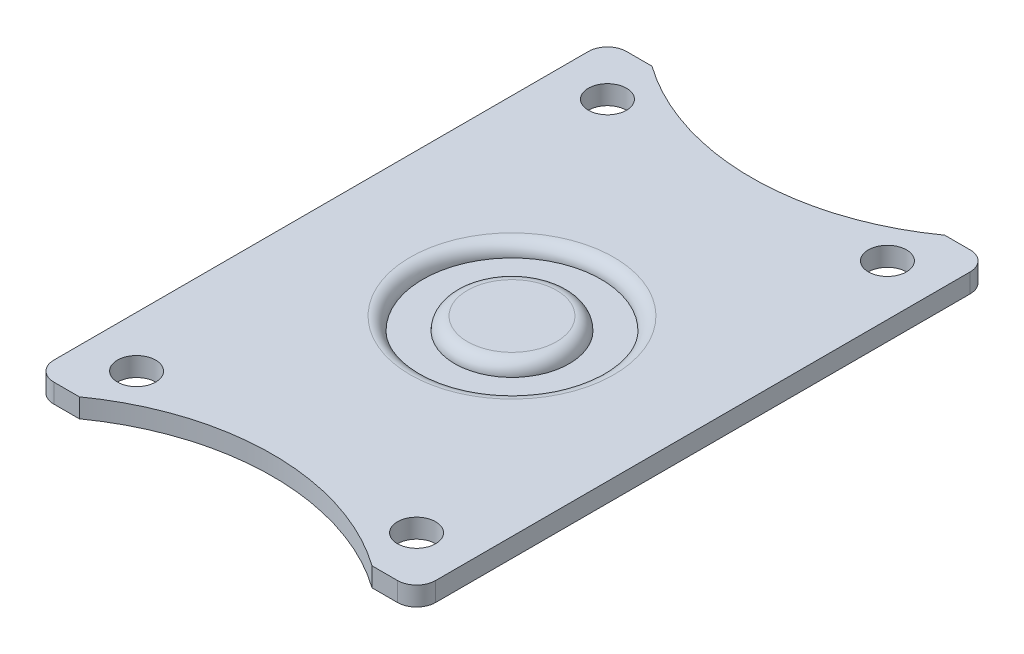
ISO-10303-21;
HEADER;
FILE_DESCRIPTION(('STEP AP214'),'2;1');
FILE_NAME('part.step','',(''),(''),'','','');
FILE_SCHEMA(('AUTOMOTIVE_DESIGN { 1 0 10303 214 1 1 1 1 }'));
ENDSEC;
DATA;
#1=APPLICATION_CONTEXT('core data for automotive mechanical design processes');
#2=APPLICATION_PROTOCOL_DEFINITION('international standard','automotive_design',2000,#1);
#3=PRODUCT_CONTEXT('',#1,'mechanical');
#4=PRODUCT('Part','Part','',(#3));
#5=PRODUCT_RELATED_PRODUCT_CATEGORY('part','',(#4));
#6=PRODUCT_DEFINITION_FORMATION('','',#4);
#7=PRODUCT_DEFINITION_CONTEXT('part definition',#1,'design');
#8=PRODUCT_DEFINITION('design','',#6,#7);
#9=PRODUCT_DEFINITION_SHAPE('','',#8);
#10=(LENGTH_UNIT() NAMED_UNIT(*) SI_UNIT(.MILLI.,.METRE.));
#11=(NAMED_UNIT(*) PLANE_ANGLE_UNIT() SI_UNIT($,.RADIAN.));
#12=(NAMED_UNIT(*) SI_UNIT($,.STERADIAN.) SOLID_ANGLE_UNIT());
#13=UNCERTAINTY_MEASURE_WITH_UNIT(LENGTH_MEASURE(1.E-05),#10,'distance_accuracy_value','');
#14=(GEOMETRIC_REPRESENTATION_CONTEXT(3) GLOBAL_UNCERTAINTY_ASSIGNED_CONTEXT((#13)) GLOBAL_UNIT_ASSIGNED_CONTEXT((#10,
#11,#12)) REPRESENTATION_CONTEXT('',''));
#15=CARTESIAN_POINT('',(0.,0.,0.));
#16=DIRECTION('',(0.,0.,1.));
#17=DIRECTION('',(1.,0.,0.));
#18=AXIS2_PLACEMENT_3D('',#15,#16,#17);
#19=CARTESIAN_POINT('',(-30.,3.,-45.));
#20=DIRECTION('',(0.,0.,1.));
#21=DIRECTION('',(1.,0.,0.));
#22=AXIS2_PLACEMENT_3D('',#19,#20,#21);
#23=PLANE('',#22);
#24=DIRECTION('',(-1.,0.,0.));
#25=VECTOR('',#24,1.);
#26=CARTESIAN_POINT('',(-30.,0.,-45.));
#27=LINE('',#26,#25);
#28=CARTESIAN_POINT('',(27.,0.,-45.));
#29=VERTEX_POINT('',#28);
#30=CARTESIAN_POINT('',(23.,0.,-45.));
#31=VERTEX_POINT('',#30);
#32=EDGE_CURVE('E161',#29,#31,#27,.T.);
#33=ORIENTED_EDGE('',*,*,#32,.T.);
#34=DIRECTION('',(0.,1.,0.));
#35=VECTOR('',#34,1.);
#36=CARTESIAN_POINT('',(23.,-7.,-45.));
#37=LINE('',#36,#35);
#38=CARTESIAN_POINT('',(23.,3.,-45.));
#39=VERTEX_POINT('',#38);
#40=EDGE_CURVE('E58',#31,#39,#37,.T.);
#41=ORIENTED_EDGE('',*,*,#40,.T.);
#42=DIRECTION('',(-1.,0.,0.));
#43=VECTOR('',#42,1.);
#44=CARTESIAN_POINT('',(-30.,3.,-45.));
#45=LINE('',#44,#43);
#46=CARTESIAN_POINT('',(27.,3.,-45.));
#47=VERTEX_POINT('',#46);
#48=EDGE_CURVE('E276',#47,#39,#45,.T.);
#49=ORIENTED_EDGE('',*,*,#48,.F.);
#50=DIRECTION('',(0.,-1.,0.));
#51=VECTOR('',#50,1.);
#52=CARTESIAN_POINT('',(27.,3.,-45.));
#53=LINE('',#52,#51);
#54=EDGE_CURVE('E201',#47,#29,#53,.T.);
#55=ORIENTED_EDGE('',*,*,#54,.T.);
#56=EDGE_LOOP('',(#33,#41,#49,#55));
#57=FACE_BOUND('',#56,.T.);
#58=ADVANCED_FACE('F35',(#57),#23,.F.);
#59=CARTESIAN_POINT('',(-30.,3.,45.));
#60=DIRECTION('',(0.,0.,-1.));
#61=DIRECTION('',(-1.,0.,0.));
#62=AXIS2_PLACEMENT_3D('',#59,#60,#61);
#63=PLANE('',#62);
#64=DIRECTION('',(1.,0.,0.));
#65=VECTOR('',#64,1.);
#66=CARTESIAN_POINT('',(-30.,0.,45.));
#67=LINE('',#66,#65);
#68=CARTESIAN_POINT('',(-27.,0.,45.));
#69=VERTEX_POINT('',#68);
#70=CARTESIAN_POINT('',(-23.,0.,45.));
#71=VERTEX_POINT('',#70);
#72=EDGE_CURVE('E139',#69,#71,#67,.T.);
#73=ORIENTED_EDGE('',*,*,#72,.T.);
#74=DIRECTION('',(0.,1.,0.));
#75=VECTOR('',#74,1.);
#76=CARTESIAN_POINT('',(-23.,-7.,45.));
#77=LINE('',#76,#75);
#78=CARTESIAN_POINT('',(-23.,3.,45.));
#79=VERTEX_POINT('',#78);
#80=EDGE_CURVE('E50',#71,#79,#77,.T.);
#81=ORIENTED_EDGE('',*,*,#80,.T.);
#82=DIRECTION('',(1.,0.,0.));
#83=VECTOR('',#82,1.);
#84=CARTESIAN_POINT('',(-30.,3.,45.));
#85=LINE('',#84,#83);
#86=CARTESIAN_POINT('',(-27.,3.,45.));
#87=VERTEX_POINT('',#86);
#88=EDGE_CURVE('E136',#87,#79,#85,.T.);
#89=ORIENTED_EDGE('',*,*,#88,.F.);
#90=DIRECTION('',(0.,-1.,0.));
#91=VECTOR('',#90,1.);
#92=CARTESIAN_POINT('',(-27.,3.,45.));
#93=LINE('',#92,#91);
#94=EDGE_CURVE('E219',#87,#69,#93,.T.);
#95=ORIENTED_EDGE('',*,*,#94,.T.);
#96=EDGE_LOOP('',(#73,#81,#89,#95));
#97=FACE_BOUND('',#96,.T.);
#98=ADVANCED_FACE('F134',(#97),#63,.F.);
#99=CARTESIAN_POINT('',(30.,3.,-45.));
#100=DIRECTION('',(-1.,0.,0.));
#101=DIRECTION('',(0.,0.,1.));
#102=AXIS2_PLACEMENT_3D('',#99,#100,#101);
#103=PLANE('',#102);
#104=DIRECTION('',(0.,0.,-1.));
#105=VECTOR('',#104,1.);
#106=CARTESIAN_POINT('',(30.,0.,-45.));
#107=LINE('',#106,#105);
#108=CARTESIAN_POINT('',(30.,0.,42.));
#109=VERTEX_POINT('',#108);
#110=CARTESIAN_POINT('',(30.,0.,-42.));
#111=VERTEX_POINT('',#110);
#112=EDGE_CURVE('E156',#109,#111,#107,.T.);
#113=ORIENTED_EDGE('',*,*,#112,.T.);
#114=DIRECTION('',(0.,-1.,0.));
#115=VECTOR('',#114,1.);
#116=CARTESIAN_POINT('',(30.,3.,-42.));
#117=LINE('',#116,#115);
#118=CARTESIAN_POINT('',(30.,3.,-42.));
#119=VERTEX_POINT('',#118);
#120=EDGE_CURVE('E217',#111,#119,#117,.F.);
#121=ORIENTED_EDGE('',*,*,#120,.T.);
#122=DIRECTION('',(0.,0.,-1.));
#123=VECTOR('',#122,1.);
#124=CARTESIAN_POINT('',(30.,3.,-45.));
#125=LINE('',#124,#123);
#126=CARTESIAN_POINT('',(30.,3.,42.));
#127=VERTEX_POINT('',#126);
#128=EDGE_CURVE('E169',#127,#119,#125,.T.);
#129=ORIENTED_EDGE('',*,*,#128,.F.);
#130=DIRECTION('',(0.,-1.,0.));
#131=VECTOR('',#130,1.);
#132=CARTESIAN_POINT('',(30.,3.,42.));
#133=LINE('',#132,#131);
#134=EDGE_CURVE('E214',#127,#109,#133,.T.);
#135=ORIENTED_EDGE('',*,*,#134,.T.);
#136=EDGE_LOOP('',(#113,#121,#129,#135));
#137=FACE_BOUND('',#136,.T.);
#138=ADVANCED_FACE('F318',(#137),#103,.F.);
#139=CARTESIAN_POINT('',(-23.,3.,-45.));
#140=VERTEX_POINT('',#139);
#141=CARTESIAN_POINT('',(-27.,3.,-45.));
#142=VERTEX_POINT('',#141);
#143=EDGE_CURVE('E275',#140,#142,#45,.T.);
#144=ORIENTED_EDGE('',*,*,#143,.F.);
#145=DIRECTION('',(0.,1.,0.));
#146=VECTOR('',#145,1.);
#147=CARTESIAN_POINT('',(-23.,-7.,-45.));
#148=LINE('',#147,#146);
#149=CARTESIAN_POINT('',(-23.,0.,-45.));
#150=VERTEX_POINT('',#149);
#151=EDGE_CURVE('E129',#150,#140,#148,.T.);
#152=ORIENTED_EDGE('',*,*,#151,.F.);
#153=CARTESIAN_POINT('',(-27.,0.,-45.));
#154=VERTEX_POINT('',#153);
#155=EDGE_CURVE('E159',#150,#154,#27,.T.);
#156=ORIENTED_EDGE('',*,*,#155,.T.);
#157=DIRECTION('',(0.,-1.,0.));
#158=VECTOR('',#157,1.);
#159=CARTESIAN_POINT('',(-27.,3.,-45.));
#160=LINE('',#159,#158);
#161=EDGE_CURVE('E204',#154,#142,#160,.F.);
#162=ORIENTED_EDGE('',*,*,#161,.T.);
#163=EDGE_LOOP('',(#144,#152,#156,#162));
#164=FACE_BOUND('',#163,.T.);
#165=ADVANCED_FACE('F286',(#164),#23,.F.);
#166=CARTESIAN_POINT('',(-30.,3.,-45.));
#167=DIRECTION('',(1.,0.,0.));
#168=DIRECTION('',(0.,0.,-1.));
#169=AXIS2_PLACEMENT_3D('',#166,#167,#168);
#170=PLANE('',#169);
#171=DIRECTION('',(0.,0.,1.));
#172=VECTOR('',#171,1.);
#173=CARTESIAN_POINT('',(-30.,3.,-45.));
#174=LINE('',#173,#172);
#175=CARTESIAN_POINT('',(-30.,3.,-42.));
#176=VERTEX_POINT('',#175);
#177=CARTESIAN_POINT('',(-30.,3.,42.));
#178=VERTEX_POINT('',#177);
#179=EDGE_CURVE('E152',#176,#178,#174,.T.);
#180=ORIENTED_EDGE('',*,*,#179,.F.);
#181=DIRECTION('',(0.,-1.,0.));
#182=VECTOR('',#181,1.);
#183=CARTESIAN_POINT('',(-30.,3.,-42.));
#184=LINE('',#183,#182);
#185=CARTESIAN_POINT('',(-30.,0.,-42.));
#186=VERTEX_POINT('',#185);
#187=EDGE_CURVE('E188',#176,#186,#184,.T.);
#188=ORIENTED_EDGE('',*,*,#187,.T.);
#189=DIRECTION('',(0.,0.,1.));
#190=VECTOR('',#189,1.);
#191=CARTESIAN_POINT('',(-30.,0.,-45.));
#192=LINE('',#191,#190);
#193=CARTESIAN_POINT('',(-30.,0.,42.));
#194=VERTEX_POINT('',#193);
#195=EDGE_CURVE('E164',#186,#194,#192,.T.);
#196=ORIENTED_EDGE('',*,*,#195,.T.);
#197=DIRECTION('',(0.,-1.,0.));
#198=VECTOR('',#197,1.);
#199=CARTESIAN_POINT('',(-30.,3.,42.));
#200=LINE('',#199,#198);
#201=EDGE_CURVE('E177',#194,#178,#200,.F.);
#202=ORIENTED_EDGE('',*,*,#201,.T.);
#203=EDGE_LOOP('',(#180,#188,#196,#202));
#204=FACE_BOUND('',#203,.T.);
#205=ADVANCED_FACE('F293',(#204),#170,.F.);
#206=CARTESIAN_POINT('',(23.,3.,45.));
#207=VERTEX_POINT('',#206);
#208=CARTESIAN_POINT('',(27.,3.,45.));
#209=VERTEX_POINT('',#208);
#210=EDGE_CURVE('E147',#207,#209,#85,.T.);
#211=ORIENTED_EDGE('',*,*,#210,.F.);
#212=DIRECTION('',(0.,1.,0.));
#213=VECTOR('',#212,1.);
#214=CARTESIAN_POINT('',(23.,-7.,45.));
#215=LINE('',#214,#213);
#216=CARTESIAN_POINT('',(23.,0.,45.));
#217=VERTEX_POINT('',#216);
#218=EDGE_CURVE('E125',#217,#207,#215,.T.);
#219=ORIENTED_EDGE('',*,*,#218,.F.);
#220=CARTESIAN_POINT('',(27.,0.,45.));
#221=VERTEX_POINT('',#220);
#222=EDGE_CURVE('E167',#217,#221,#67,.T.);
#223=ORIENTED_EDGE('',*,*,#222,.T.);
#224=DIRECTION('',(0.,-1.,0.));
#225=VECTOR('',#224,1.);
#226=CARTESIAN_POINT('',(27.,3.,45.));
#227=LINE('',#226,#225);
#228=EDGE_CURVE('E221',#221,#209,#227,.F.);
#229=ORIENTED_EDGE('',*,*,#228,.T.);
#230=EDGE_LOOP('',(#211,#219,#223,#229));
#231=FACE_BOUND('',#230,.T.);
#232=ADVANCED_FACE('F320',(#231),#63,.F.);
#233=CARTESIAN_POINT('',(0.,3.,0.));
#234=DIRECTION('',(0.,1.,0.));
#235=DIRECTION('',(0.,0.,1.));
#236=AXIS2_PLACEMENT_3D('',#233,#234,#235);
#237=PLANE('',#236);
#238=CARTESIAN_POINT('',(0.,3.,0.));
#239=DIRECTION('',(0.,1.,0.));
#240=DIRECTION('',(0.,0.,1.));
#241=AXIS2_PLACEMENT_3D('',#238,#239,#240);
#242=CIRCLE('',#241,16.);
#243=CARTESIAN_POINT('',(0.,3.,16.));
#244=VERTEX_POINT('',#243);
#245=EDGE_CURVE('E43',#244,#244,#242,.F.);
#246=ORIENTED_EDGE('',*,*,#245,.T.);
#247=EDGE_LOOP('',(#246));
#248=FACE_BOUND('',#247,.T.);
#249=CARTESIAN_POINT('',(0.,3.,77.2554782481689));
#250=DIRECTION('',(0.,1.,0.));
#251=DIRECTION('',(0.,0.,-1.));
#252=AXIS2_PLACEMENT_3D('',#249,#250,#251);
#253=CIRCLE('',#252,39.6158538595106);
#254=EDGE_CURVE('E122',#207,#79,#253,.T.);
#255=ORIENTED_EDGE('',*,*,#254,.F.);
#256=ORIENTED_EDGE('',*,*,#210,.T.);
#257=CARTESIAN_POINT('',(27.,3.,42.));
#258=DIRECTION('',(0.,1.,0.));
#259=DIRECTION('',(0.,0.,1.));
#260=AXIS2_PLACEMENT_3D('',#257,#258,#259);
#261=CIRCLE('',#260,3.);
#262=EDGE_CURVE('E208',#209,#127,#261,.T.);
#263=ORIENTED_EDGE('',*,*,#262,.T.);
#264=ORIENTED_EDGE('',*,*,#128,.T.);
#265=CARTESIAN_POINT('',(27.,3.,-42.));
#266=DIRECTION('',(0.,1.,0.));
#267=DIRECTION('',(0.,0.,1.));
#268=AXIS2_PLACEMENT_3D('',#265,#266,#267);
#269=CIRCLE('',#268,3.);
#270=EDGE_CURVE('E210',#119,#47,#269,.T.);
#271=ORIENTED_EDGE('',*,*,#270,.T.);
#272=ORIENTED_EDGE('',*,*,#48,.T.);
#273=CARTESIAN_POINT('',(0.,3.,-77.2554782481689));
#274=DIRECTION('',(0.,1.,0.));
#275=DIRECTION('',(0.,0.,1.));
#276=AXIS2_PLACEMENT_3D('',#273,#274,#275);
#277=CIRCLE('',#276,39.6158538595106);
#278=EDGE_CURVE('E240',#140,#39,#277,.T.);
#279=ORIENTED_EDGE('',*,*,#278,.F.);
#280=ORIENTED_EDGE('',*,*,#143,.T.);
#281=CARTESIAN_POINT('',(-27.,3.,-42.));
#282=DIRECTION('',(0.,1.,0.));
#283=DIRECTION('',(0.,0.,1.));
#284=AXIS2_PLACEMENT_3D('',#281,#282,#283);
#285=CIRCLE('',#284,3.);
#286=EDGE_CURVE('E212',#142,#176,#285,.T.);
#287=ORIENTED_EDGE('',*,*,#286,.T.);
#288=ORIENTED_EDGE('',*,*,#179,.T.);
#289=CARTESIAN_POINT('',(-27.,3.,42.));
#290=DIRECTION('',(0.,1.,0.));
#291=DIRECTION('',(0.,0.,1.));
#292=AXIS2_PLACEMENT_3D('',#289,#290,#291);
#293=CIRCLE('',#292,3.);
#294=EDGE_CURVE('E145',#178,#87,#293,.T.);
#295=ORIENTED_EDGE('',*,*,#294,.T.);
#296=ORIENTED_EDGE('',*,*,#88,.T.);
#297=EDGE_LOOP('',(#255,#256,#263,#264,#271,#272,#279,#280,#287,#288,#295,#296));
#298=FACE_BOUND('',#297,.T.);
#299=CARTESIAN_POINT('',(-22.,3.,-37.));
#300=DIRECTION('',(0.,1.,0.));
#301=DIRECTION('',(0.,0.,1.));
#302=AXIS2_PLACEMENT_3D('',#299,#300,#301);
#303=CIRCLE('',#302,3.);
#304=CARTESIAN_POINT('',(-22.,3.,-34.));
#305=VERTEX_POINT('',#304);
#306=EDGE_CURVE('E247',#305,#305,#303,.T.);
#307=ORIENTED_EDGE('',*,*,#306,.F.);
#308=EDGE_LOOP('',(#307));
#309=FACE_BOUND('',#308,.T.);
#310=CARTESIAN_POINT('',(22.,3.,-37.));
#311=DIRECTION('',(0.,1.,0.));
#312=DIRECTION('',(0.,0.,1.));
#313=AXIS2_PLACEMENT_3D('',#310,#311,#312);
#314=CIRCLE('',#313,3.);
#315=CARTESIAN_POINT('',(22.,3.,-34.));
#316=VERTEX_POINT('',#315);
#317=EDGE_CURVE('E256',#316,#316,#314,.T.);
#318=ORIENTED_EDGE('',*,*,#317,.F.);
#319=EDGE_LOOP('',(#318));
#320=FACE_BOUND('',#319,.T.);
#321=CARTESIAN_POINT('',(-22.,3.,37.));
#322=DIRECTION('',(0.,1.,0.));
#323=DIRECTION('',(0.,0.,1.));
#324=AXIS2_PLACEMENT_3D('',#321,#322,#323);
#325=CIRCLE('',#324,3.);
#326=CARTESIAN_POINT('',(-22.,3.,40.));
#327=VERTEX_POINT('',#326);
#328=EDGE_CURVE('E186',#327,#327,#325,.T.);
#329=ORIENTED_EDGE('',*,*,#328,.F.);
#330=EDGE_LOOP('',(#329));
#331=FACE_BOUND('',#330,.T.);
#332=CARTESIAN_POINT('',(22.,3.,37.));
#333=DIRECTION('',(0.,1.,0.));
#334=DIRECTION('',(0.,0.,1.));
#335=AXIS2_PLACEMENT_3D('',#332,#333,#334);
#336=CIRCLE('',#335,3.);
#337=CARTESIAN_POINT('',(22.,3.,40.));
#338=VERTEX_POINT('',#337);
#339=EDGE_CURVE('E182',#338,#338,#336,.T.);
#340=ORIENTED_EDGE('',*,*,#339,.F.);
#341=EDGE_LOOP('',(#340));
#342=FACE_BOUND('',#341,.T.);
#343=ADVANCED_FACE('F141',(#248,#298,#309,#320,#331,#342),#237,.T.);
#344=CARTESIAN_POINT('',(0.,0.,0.));
#345=DIRECTION('',(0.,1.,0.));
#346=DIRECTION('',(0.,0.,1.));
#347=AXIS2_PLACEMENT_3D('',#344,#345,#346);
#348=PLANE('',#347);
#349=CARTESIAN_POINT('',(-22.,0.,-37.));
#350=DIRECTION('',(0.,1.,0.));
#351=DIRECTION('',(0.,0.,1.));
#352=AXIS2_PLACEMENT_3D('',#349,#350,#351);
#353=CIRCLE('',#352,3.);
#354=CARTESIAN_POINT('',(-22.,0.,-34.));
#355=VERTEX_POINT('',#354);
#356=EDGE_CURVE('E253',#355,#355,#353,.T.);
#357=ORIENTED_EDGE('',*,*,#356,.T.);
#358=EDGE_LOOP('',(#357));
#359=FACE_BOUND('',#358,.T.);
#360=CARTESIAN_POINT('',(22.,0.,-37.));
#361=DIRECTION('',(0.,1.,0.));
#362=DIRECTION('',(0.,0.,1.));
#363=AXIS2_PLACEMENT_3D('',#360,#361,#362);
#364=CIRCLE('',#363,3.);
#365=CARTESIAN_POINT('',(22.,0.,-34.));
#366=VERTEX_POINT('',#365);
#367=EDGE_CURVE('E259',#366,#366,#364,.T.);
#368=ORIENTED_EDGE('',*,*,#367,.T.);
#369=EDGE_LOOP('',(#368));
#370=FACE_BOUND('',#369,.T.);
#371=CARTESIAN_POINT('',(-22.,0.,37.));
#372=DIRECTION('',(0.,1.,0.));
#373=DIRECTION('',(0.,0.,1.));
#374=AXIS2_PLACEMENT_3D('',#371,#372,#373);
#375=CIRCLE('',#374,3.);
#376=CARTESIAN_POINT('',(-22.,0.,40.));
#377=VERTEX_POINT('',#376);
#378=EDGE_CURVE('E183',#377,#377,#375,.T.);
#379=ORIENTED_EDGE('',*,*,#378,.T.);
#380=EDGE_LOOP('',(#379));
#381=FACE_BOUND('',#380,.T.);
#382=CARTESIAN_POINT('',(22.,0.,37.));
#383=DIRECTION('',(0.,1.,0.));
#384=DIRECTION('',(0.,0.,1.));
#385=AXIS2_PLACEMENT_3D('',#382,#383,#384);
#386=CIRCLE('',#385,3.);
#387=CARTESIAN_POINT('',(22.,0.,40.));
#388=VERTEX_POINT('',#387);
#389=EDGE_CURVE('E178',#388,#388,#386,.T.);
#390=ORIENTED_EDGE('',*,*,#389,.T.);
#391=EDGE_LOOP('',(#390));
#392=FACE_BOUND('',#391,.T.);
#393=CARTESIAN_POINT('',(0.,0.,0.));
#394=DIRECTION('',(0.,-1.,0.));
#395=DIRECTION('',(0.,0.,-1.));
#396=AXIS2_PLACEMENT_3D('',#393,#394,#395);
#397=CIRCLE('',#396,11.);
#398=CARTESIAN_POINT('',(0.,0.,-11.));
#399=VERTEX_POINT('',#398);
#400=EDGE_CURVE('E146',#399,#399,#397,.T.);
#401=ORIENTED_EDGE('',*,*,#400,.F.);
#402=EDGE_LOOP('',(#401));
#403=FACE_BOUND('',#402,.T.);
#404=ORIENTED_EDGE('',*,*,#222,.F.);
#405=CARTESIAN_POINT('',(0.,0.,77.2554782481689));
#406=DIRECTION('',(0.,1.,0.));
#407=DIRECTION('',(0.,0.,1.));
#408=AXIS2_PLACEMENT_3D('',#405,#406,#407);
#409=CIRCLE('',#408,39.6158538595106);
#410=EDGE_CURVE('E226',#217,#71,#409,.T.);
#411=ORIENTED_EDGE('',*,*,#410,.T.);
#412=ORIENTED_EDGE('',*,*,#72,.F.);
#413=CARTESIAN_POINT('',(-27.,0.,42.));
#414=DIRECTION('',(0.,1.,0.));
#415=DIRECTION('',(0.,0.,1.));
#416=AXIS2_PLACEMENT_3D('',#413,#414,#415);
#417=CIRCLE('',#416,3.);
#418=EDGE_CURVE('E191',#69,#194,#417,.F.);
#419=ORIENTED_EDGE('',*,*,#418,.T.);
#420=ORIENTED_EDGE('',*,*,#195,.F.);
#421=CARTESIAN_POINT('',(-27.,0.,-42.));
#422=DIRECTION('',(0.,1.,0.));
#423=DIRECTION('',(0.,0.,1.));
#424=AXIS2_PLACEMENT_3D('',#421,#422,#423);
#425=CIRCLE('',#424,3.);
#426=EDGE_CURVE('E198',#186,#154,#425,.F.);
#427=ORIENTED_EDGE('',*,*,#426,.T.);
#428=ORIENTED_EDGE('',*,*,#155,.F.);
#429=CARTESIAN_POINT('',(0.,0.,-77.2554782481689));
#430=DIRECTION('',(0.,1.,0.));
#431=DIRECTION('',(0.,0.,1.));
#432=AXIS2_PLACEMENT_3D('',#429,#430,#431);
#433=CIRCLE('',#432,39.6158538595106);
#434=EDGE_CURVE('E224',#150,#31,#433,.T.);
#435=ORIENTED_EDGE('',*,*,#434,.T.);
#436=ORIENTED_EDGE('',*,*,#32,.F.);
#437=CARTESIAN_POINT('',(27.,0.,-42.));
#438=DIRECTION('',(0.,1.,0.));
#439=DIRECTION('',(0.,0.,1.));
#440=AXIS2_PLACEMENT_3D('',#437,#438,#439);
#441=CIRCLE('',#440,3.);
#442=EDGE_CURVE('E196',#29,#111,#441,.F.);
#443=ORIENTED_EDGE('',*,*,#442,.T.);
#444=ORIENTED_EDGE('',*,*,#112,.F.);
#445=CARTESIAN_POINT('',(27.,0.,42.));
#446=DIRECTION('',(0.,1.,0.));
#447=DIRECTION('',(0.,0.,1.));
#448=AXIS2_PLACEMENT_3D('',#445,#446,#447);
#449=CIRCLE('',#448,3.);
#450=EDGE_CURVE('E193',#109,#221,#449,.F.);
#451=ORIENTED_EDGE('',*,*,#450,.T.);
#452=EDGE_LOOP('',(#404,#411,#412,#419,#420,#427,#428,#435,#436,#443,#444,#451));
#453=FACE_BOUND('',#452,.T.);
#454=ADVANCED_FACE('F297',(#359,#370,#381,#392,#403,#453),#348,.F.);
#455=CARTESIAN_POINT('',(0.,-2.,0.));
#456=DIRECTION('',(0.,1.,0.));
#457=DIRECTION('',(0.,0.,1.));
#458=AXIS2_PLACEMENT_3D('',#455,#456,#457);
#459=CYLINDRICAL_SURFACE('',#458,11.);
#460=CARTESIAN_POINT('',(0.,-2.,0.));
#461=DIRECTION('',(0.,-1.,0.));
#462=DIRECTION('',(0.,0.,-1.));
#463=AXIS2_PLACEMENT_3D('',#460,#461,#462);
#464=CIRCLE('',#463,11.);
#465=CARTESIAN_POINT('',(0.,-2.,-11.));
#466=VERTEX_POINT('',#465);
#467=EDGE_CURVE('E160',#466,#466,#464,.T.);
#468=ORIENTED_EDGE('',*,*,#467,.F.);
#469=EDGE_LOOP('',(#468));
#470=FACE_BOUND('',#469,.T.);
#471=ORIENTED_EDGE('',*,*,#400,.T.);
#472=EDGE_LOOP('',(#471));
#473=FACE_BOUND('',#472,.T.);
#474=ADVANCED_FACE('F362',(#470,#473),#459,.T.);
#475=CARTESIAN_POINT('',(0.,-2.,0.));
#476=DIRECTION('',(0.,-1.,0.));
#477=DIRECTION('',(0.,0.,-1.));
#478=AXIS2_PLACEMENT_3D('',#475,#476,#477);
#479=PLANE('',#478);
#480=CARTESIAN_POINT('',(0.,-2.,0.));
#481=DIRECTION('',(0.,-1.,0.));
#482=DIRECTION('',(0.,0.,-1.));
#483=AXIS2_PLACEMENT_3D('',#480,#481,#482);
#484=CIRCLE('',#483,7.5);
#485=CARTESIAN_POINT('',(0.,-2.,-7.5));
#486=VERTEX_POINT('',#485);
#487=EDGE_CURVE('E150',#486,#486,#484,.T.);
#488=ORIENTED_EDGE('',*,*,#487,.F.);
#489=EDGE_LOOP('',(#488));
#490=FACE_BOUND('',#489,.T.);
#491=ORIENTED_EDGE('',*,*,#467,.T.);
#492=EDGE_LOOP('',(#491));
#493=FACE_BOUND('',#492,.T.);
#494=ADVANCED_FACE('F367',(#490,#493),#479,.T.);
#495=CARTESIAN_POINT('',(0.,-10.,0.));
#496=DIRECTION('',(0.,1.,0.));
#497=DIRECTION('',(0.,0.,1.));
#498=AXIS2_PLACEMENT_3D('',#495,#496,#497);
#499=CYLINDRICAL_SURFACE('',#498,7.5);
#500=CARTESIAN_POINT('',(0.,-10.,0.));
#501=DIRECTION('',(0.,-1.,0.));
#502=DIRECTION('',(0.,0.,-1.));
#503=AXIS2_PLACEMENT_3D('',#500,#501,#502);
#504=CIRCLE('',#503,7.5);
#505=CARTESIAN_POINT('',(0.,-10.,-7.5));
#506=VERTEX_POINT('',#505);
#507=EDGE_CURVE('E181',#506,#506,#504,.T.);
#508=ORIENTED_EDGE('',*,*,#507,.F.);
#509=EDGE_LOOP('',(#508));
#510=FACE_BOUND('',#509,.T.);
#511=ORIENTED_EDGE('',*,*,#487,.T.);
#512=EDGE_LOOP('',(#511));
#513=FACE_BOUND('',#512,.T.);
#514=ADVANCED_FACE('F371',(#510,#513),#499,.T.);
#515=CARTESIAN_POINT('',(0.,-10.,0.));
#516=DIRECTION('',(0.,-1.,0.));
#517=DIRECTION('',(0.,0.,-1.));
#518=AXIS2_PLACEMENT_3D('',#515,#516,#517);
#519=PLANE('',#518);
#520=CARTESIAN_POINT('',(0.,-10.,0.));
#521=DIRECTION('',(0.,-1.,0.));
#522=DIRECTION('',(0.,0.,-1.));
#523=AXIS2_PLACEMENT_3D('',#520,#521,#522);
#524=CIRCLE('',#523,7.15);
#525=CARTESIAN_POINT('',(0.,-10.,-7.15));
#526=VERTEX_POINT('',#525);
#527=EDGE_CURVE('E174',#526,#526,#524,.T.);
#528=ORIENTED_EDGE('',*,*,#527,.F.);
#529=EDGE_LOOP('',(#528));
#530=FACE_BOUND('',#529,.T.);
#531=ORIENTED_EDGE('',*,*,#507,.T.);
#532=EDGE_LOOP('',(#531));
#533=FACE_BOUND('',#532,.T.);
#534=ADVANCED_FACE('F375',(#530,#533),#519,.T.);
#535=CARTESIAN_POINT('',(0.,-12.5,0.));
#536=DIRECTION('',(0.,1.,0.));
#537=DIRECTION('',(0.,0.,1.));
#538=AXIS2_PLACEMENT_3D('',#535,#536,#537);
#539=CYLINDRICAL_SURFACE('',#538,7.15);
#540=CARTESIAN_POINT('',(0.,-12.,0.));
#541=DIRECTION('',(0.,-1.,0.));
#542=DIRECTION('',(0.,0.,-1.));
#543=AXIS2_PLACEMENT_3D('',#540,#541,#542);
#544=CIRCLE('',#543,7.15);
#545=CARTESIAN_POINT('',(0.,-12.,-7.15));
#546=VERTEX_POINT('',#545);
#547=EDGE_CURVE('E173',#546,#546,#544,.F.);
#548=ORIENTED_EDGE('',*,*,#547,.T.);
#549=EDGE_LOOP('',(#548));
#550=FACE_BOUND('',#549,.T.);
#551=ORIENTED_EDGE('',*,*,#527,.T.);
#552=EDGE_LOOP('',(#551));
#553=FACE_BOUND('',#552,.T.);
#554=ADVANCED_FACE('F379',(#550,#553),#539,.T.);
#555=CARTESIAN_POINT('',(0.,-12.5,0.));
#556=DIRECTION('',(0.,-1.,0.));
#557=DIRECTION('',(0.,0.,-1.));
#558=AXIS2_PLACEMENT_3D('',#555,#556,#557);
#559=PLANE('',#558);
#560=CARTESIAN_POINT('',(0.,-12.5,0.));
#561=DIRECTION('',(0.,-1.,0.));
#562=DIRECTION('',(0.,0.,-1.));
#563=AXIS2_PLACEMENT_3D('',#560,#561,#562);
#564=CIRCLE('',#563,6.65000000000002);
#565=CARTESIAN_POINT('',(0.,-12.5,-6.65000000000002));
#566=VERTEX_POINT('',#565);
#567=EDGE_CURVE('E170',#566,#566,#564,.T.);
#568=ORIENTED_EDGE('',*,*,#567,.T.);
#569=EDGE_LOOP('',(#568));
#570=FACE_BOUND('',#569,.T.);
#571=ADVANCED_FACE('F336',(#570),#559,.T.);
#572=CARTESIAN_POINT('',(0.,-12.5,0.));
#573=DIRECTION('',(0.,1.,0.));
#574=DIRECTION('',(0.,0.,1.));
#575=AXIS2_PLACEMENT_3D('',#572,#573,#574);
#576=CONICAL_SURFACE('',#575,6.65000000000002,0.785398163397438);
#577=ORIENTED_EDGE('',*,*,#547,.F.);
#578=EDGE_LOOP('',(#577));
#579=FACE_BOUND('',#578,.T.);
#580=ORIENTED_EDGE('',*,*,#567,.F.);
#581=EDGE_LOOP('',(#580));
#582=FACE_BOUND('',#581,.T.);
#583=ADVANCED_FACE('F332',(#579,#582),#576,.T.);
#584=CARTESIAN_POINT('',(22.,3.,37.));
#585=DIRECTION('',(0.,1.,0.));
#586=DIRECTION('',(0.,0.,1.));
#587=AXIS2_PLACEMENT_3D('',#584,#585,#586);
#588=CYLINDRICAL_SURFACE('',#587,3.);
#589=ORIENTED_EDGE('',*,*,#339,.T.);
#590=EDGE_LOOP('',(#589));
#591=FACE_BOUND('',#590,.T.);
#592=ORIENTED_EDGE('',*,*,#389,.F.);
#593=EDGE_LOOP('',(#592));
#594=FACE_BOUND('',#593,.T.);
#595=ADVANCED_FACE('F335',(#591,#594),#588,.F.);
#596=CARTESIAN_POINT('',(-22.,3.,37.));
#597=DIRECTION('',(0.,1.,0.));
#598=DIRECTION('',(0.,0.,1.));
#599=AXIS2_PLACEMENT_3D('',#596,#597,#598);
#600=CYLINDRICAL_SURFACE('',#599,3.);
#601=ORIENTED_EDGE('',*,*,#328,.T.);
#602=EDGE_LOOP('',(#601));
#603=FACE_BOUND('',#602,.T.);
#604=ORIENTED_EDGE('',*,*,#378,.F.);
#605=EDGE_LOOP('',(#604));
#606=FACE_BOUND('',#605,.T.);
#607=ADVANCED_FACE('F389',(#603,#606),#600,.F.);
#608=CARTESIAN_POINT('',(22.,3.,-37.));
#609=DIRECTION('',(0.,1.,0.));
#610=DIRECTION('',(0.,0.,1.));
#611=AXIS2_PLACEMENT_3D('',#608,#609,#610);
#612=CYLINDRICAL_SURFACE('',#611,3.);
#613=ORIENTED_EDGE('',*,*,#317,.T.);
#614=EDGE_LOOP('',(#613));
#615=FACE_BOUND('',#614,.T.);
#616=ORIENTED_EDGE('',*,*,#367,.F.);
#617=EDGE_LOOP('',(#616));
#618=FACE_BOUND('',#617,.T.);
#619=ADVANCED_FACE('F393',(#615,#618),#612,.F.);
#620=CARTESIAN_POINT('',(-22.,3.,-37.));
#621=DIRECTION('',(0.,1.,0.));
#622=DIRECTION('',(0.,0.,1.));
#623=AXIS2_PLACEMENT_3D('',#620,#621,#622);
#624=CYLINDRICAL_SURFACE('',#623,3.);
#625=ORIENTED_EDGE('',*,*,#306,.T.);
#626=EDGE_LOOP('',(#625));
#627=FACE_BOUND('',#626,.T.);
#628=ORIENTED_EDGE('',*,*,#356,.F.);
#629=EDGE_LOOP('',(#628));
#630=FACE_BOUND('',#629,.T.);
#631=ADVANCED_FACE('F340',(#627,#630),#624,.F.);
#632=CARTESIAN_POINT('',(-27.,3.,-42.));
#633=DIRECTION('',(0.,-1.,0.));
#634=DIRECTION('',(0.,0.,-1.));
#635=AXIS2_PLACEMENT_3D('',#632,#633,#634);
#636=CYLINDRICAL_SURFACE('',#635,3.);
#637=ORIENTED_EDGE('',*,*,#286,.F.);
#638=ORIENTED_EDGE('',*,*,#161,.F.);
#639=ORIENTED_EDGE('',*,*,#426,.F.);
#640=ORIENTED_EDGE('',*,*,#187,.F.);
#641=EDGE_LOOP('',(#637,#638,#639,#640));
#642=FACE_BOUND('',#641,.T.);
#643=ADVANCED_FACE('F290',(#642),#636,.T.);
#644=CARTESIAN_POINT('',(27.,3.,-42.));
#645=DIRECTION('',(0.,-1.,0.));
#646=DIRECTION('',(0.,0.,-1.));
#647=AXIS2_PLACEMENT_3D('',#644,#645,#646);
#648=CYLINDRICAL_SURFACE('',#647,3.);
#649=ORIENTED_EDGE('',*,*,#270,.F.);
#650=ORIENTED_EDGE('',*,*,#120,.F.);
#651=ORIENTED_EDGE('',*,*,#442,.F.);
#652=ORIENTED_EDGE('',*,*,#54,.F.);
#653=EDGE_LOOP('',(#649,#650,#651,#652));
#654=FACE_BOUND('',#653,.T.);
#655=ADVANCED_FACE('F309',(#654),#648,.T.);
#656=CARTESIAN_POINT('',(27.,3.,42.));
#657=DIRECTION('',(0.,-1.,0.));
#658=DIRECTION('',(0.,0.,-1.));
#659=AXIS2_PLACEMENT_3D('',#656,#657,#658);
#660=CYLINDRICAL_SURFACE('',#659,3.);
#661=ORIENTED_EDGE('',*,*,#262,.F.);
#662=ORIENTED_EDGE('',*,*,#228,.F.);
#663=ORIENTED_EDGE('',*,*,#450,.F.);
#664=ORIENTED_EDGE('',*,*,#134,.F.);
#665=EDGE_LOOP('',(#661,#662,#663,#664));
#666=FACE_BOUND('',#665,.T.);
#667=ADVANCED_FACE('F302',(#666),#660,.T.);
#668=CARTESIAN_POINT('',(-27.,3.,42.));
#669=DIRECTION('',(0.,-1.,0.));
#670=DIRECTION('',(0.,0.,-1.));
#671=AXIS2_PLACEMENT_3D('',#668,#669,#670);
#672=CYLINDRICAL_SURFACE('',#671,3.);
#673=ORIENTED_EDGE('',*,*,#294,.F.);
#674=ORIENTED_EDGE('',*,*,#201,.F.);
#675=ORIENTED_EDGE('',*,*,#418,.F.);
#676=ORIENTED_EDGE('',*,*,#94,.F.);
#677=EDGE_LOOP('',(#673,#674,#675,#676));
#678=FACE_BOUND('',#677,.T.);
#679=ADVANCED_FACE('F299',(#678),#672,.T.);
#680=CARTESIAN_POINT('',(0.,-7.,-77.2554782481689));
#681=DIRECTION('',(0.,1.,0.));
#682=DIRECTION('',(0.,0.,1.));
#683=AXIS2_PLACEMENT_3D('',#680,#681,#682);
#684=CYLINDRICAL_SURFACE('',#683,39.6158538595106);
#685=ORIENTED_EDGE('',*,*,#151,.T.);
#686=ORIENTED_EDGE('',*,*,#278,.T.);
#687=ORIENTED_EDGE('',*,*,#40,.F.);
#688=ORIENTED_EDGE('',*,*,#434,.F.);
#689=EDGE_LOOP('',(#685,#686,#687,#688));
#690=FACE_BOUND('',#689,.T.);
#691=ADVANCED_FACE('F301',(#690),#684,.F.);
#692=CARTESIAN_POINT('',(0.,-7.,77.2554782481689));
#693=DIRECTION('',(0.,1.,0.));
#694=DIRECTION('',(0.,0.,1.));
#695=AXIS2_PLACEMENT_3D('',#692,#693,#694);
#696=CYLINDRICAL_SURFACE('',#695,39.6158538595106);
#697=ORIENTED_EDGE('',*,*,#218,.T.);
#698=ORIENTED_EDGE('',*,*,#254,.T.);
#699=ORIENTED_EDGE('',*,*,#80,.F.);
#700=ORIENTED_EDGE('',*,*,#410,.F.);
#701=EDGE_LOOP('',(#697,#698,#699,#700));
#702=FACE_BOUND('',#701,.T.);
#703=ADVANCED_FACE('F123',(#702),#696,.F.);
#704=CARTESIAN_POINT('',(0.,1.,0.));
#705=DIRECTION('',(0.,1.,0.));
#706=DIRECTION('',(0.,0.,1.));
#707=AXIS2_PLACEMENT_3D('',#704,#705,#706);
#708=PLANE('',#707);
#709=CARTESIAN_POINT('',(0.,1.,0.));
#710=DIRECTION('',(0.,1.,0.));
#711=DIRECTION('',(0.,0.,1.));
#712=AXIS2_PLACEMENT_3D('',#709,#710,#711);
#713=CIRCLE('',#712,9.);
#714=CARTESIAN_POINT('',(0.,1.,9.));
#715=VERTEX_POINT('',#714);
#716=EDGE_CURVE('E241',#715,#715,#713,.T.);
#717=ORIENTED_EDGE('',*,*,#716,.F.);
#718=EDGE_LOOP('',(#717));
#719=FACE_BOUND('',#718,.T.);
#720=CARTESIAN_POINT('',(0.,1.,0.));
#721=DIRECTION('',(0.,1.,0.));
#722=DIRECTION('',(0.,0.,1.));
#723=AXIS2_PLACEMENT_3D('',#720,#721,#722);
#724=CIRCLE('',#723,14.);
#725=CARTESIAN_POINT('',(0.,1.,14.));
#726=VERTEX_POINT('',#725);
#727=EDGE_CURVE('E238',#726,#726,#724,.T.);
#728=ORIENTED_EDGE('',*,*,#727,.T.);
#729=EDGE_LOOP('',(#728));
#730=FACE_BOUND('',#729,.T.);
#731=ADVANCED_FACE('F235',(#719,#730),#708,.T.);
#732=CARTESIAN_POINT('',(0.,1.,0.));
#733=DIRECTION('',(0.,1.,0.));
#734=DIRECTION('',(0.,0.,1.));
#735=AXIS2_PLACEMENT_3D('',#732,#733,#734);
#736=TOROIDAL_SURFACE('',#735,16.,2.);
#737=ORIENTED_EDGE('',*,*,#245,.F.);
#738=EDGE_LOOP('',(#737));
#739=FACE_BOUND('',#738,.T.);
#740=ORIENTED_EDGE('',*,*,#727,.F.);
#741=EDGE_LOOP('',(#740));
#742=FACE_BOUND('',#741,.T.);
#743=ADVANCED_FACE('F231',(#739,#742),#736,.T.);
#744=CARTESIAN_POINT('',(0.,3.,0.));
#745=DIRECTION('',(0.,1.,0.));
#746=DIRECTION('',(0.,0.,1.));
#747=AXIS2_PLACEMENT_3D('',#744,#745,#746);
#748=PLANE('',#747);
#749=CARTESIAN_POINT('',(0.,3.,0.));
#750=DIRECTION('',(0.,1.,0.));
#751=DIRECTION('',(0.,0.,1.));
#752=AXIS2_PLACEMENT_3D('',#749,#750,#751);
#753=CIRCLE('',#752,7.);
#754=CARTESIAN_POINT('',(0.,3.,7.));
#755=VERTEX_POINT('',#754);
#756=EDGE_CURVE('E11',#755,#755,#753,.T.);
#757=ORIENTED_EDGE('',*,*,#756,.T.);
#758=EDGE_LOOP('',(#757));
#759=FACE_BOUND('',#758,.T.);
#760=ADVANCED_FACE('F234',(#759),#748,.T.);
#761=CARTESIAN_POINT('',(0.,1.,0.));
#762=DIRECTION('',(0.,1.,0.));
#763=DIRECTION('',(0.,0.,1.));
#764=AXIS2_PLACEMENT_3D('',#761,#762,#763);
#765=TOROIDAL_SURFACE('',#764,7.,2.);
#766=ORIENTED_EDGE('',*,*,#716,.T.);
#767=EDGE_LOOP('',(#766));
#768=FACE_BOUND('',#767,.T.);
#769=ORIENTED_EDGE('',*,*,#756,.F.);
#770=EDGE_LOOP('',(#769));
#771=FACE_BOUND('',#770,.T.);
#772=ADVANCED_FACE('F37',(#768,#771),#765,.T.);
#773=CLOSED_SHELL('',(#58,#98,#138,#165,#205,#232,#343,#454,#474,#494,#514,#534,#554,#571,#583,
#595,#607,#619,#631,#643,#655,#667,#679,#691,#703,#731,#743,#760,#772));
#774=MANIFOLD_SOLID_BREP('B2',#773);
#775=ADVANCED_BREP_SHAPE_REPRESENTATION('',(#18,#774),#14);
#776=SHAPE_DEFINITION_REPRESENTATION(#9,#775);
ENDSEC;
END-ISO-10303-21;
